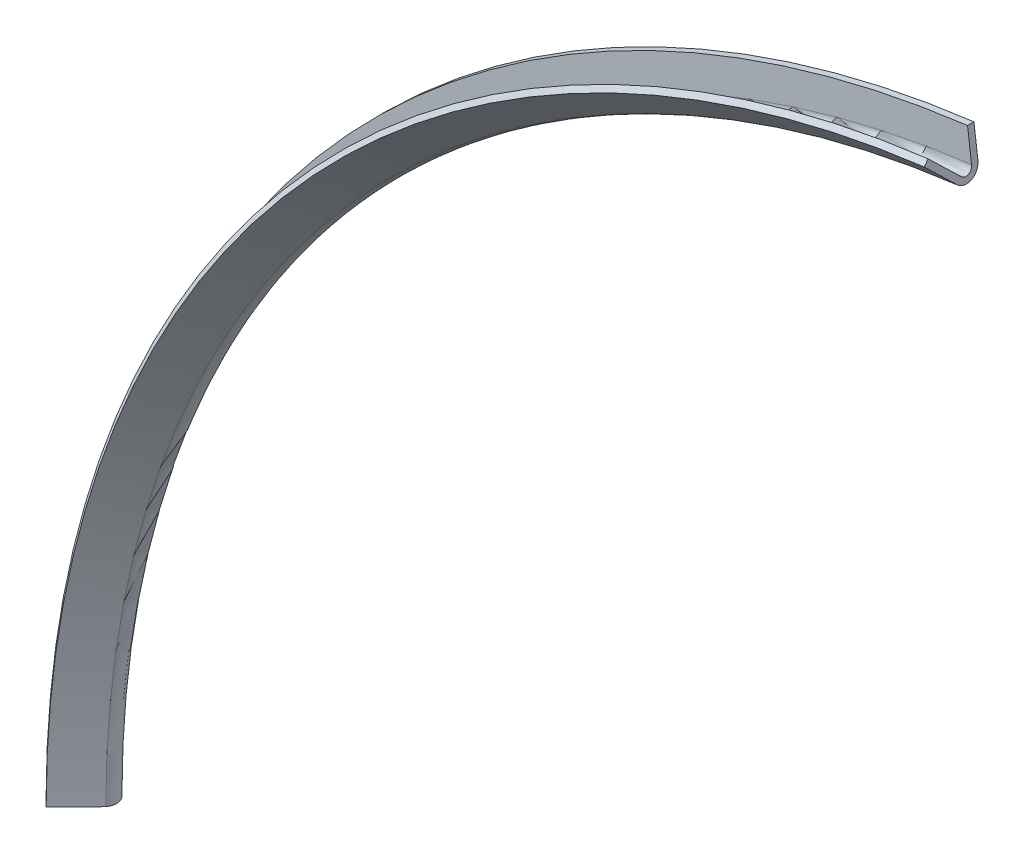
from build123d import *


with BuildPart() as part:
    # Sweep 1: sweep along a path in Sketch 1
    with BuildLine(Plane.XY) as sweep_1_path:
        ThreePointArc((-151, 0), (-113.141504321, 100), (-18.549668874, 149.856297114))
    # Sketch 2 → Sweep 1 (sweep)
    with BuildSketch(Plane(origin=(0, 0, 0), x_dir=(1, 0, 0), z_dir=(0, 1, 0))):
        with BuildLine():
            Line((-158, -1), (-153, -1))
            ThreePointArc((-153, -1), (-152.069795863, -1.522080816), (-152.143048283, -2.586262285))
            Line((-152.143048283, -2.586262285), (-156.72287902, -7.303400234))
            Line((-156.72287902, -7.303400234), (-156.005407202, -7.999987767))
            Line((-156.005407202, -7.999987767), (-151.429223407, -3.286606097))
            ThreePointArc((-151.429223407, -3.286606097), (-151.199056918, -1.157936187), (-153, 0))
            Line((-153, 0), (-158, 0))
            Line((-158, 0), (-158, -1))
        make_face()
    sweep(path=sweep_1_path.line)


solid = part.part
